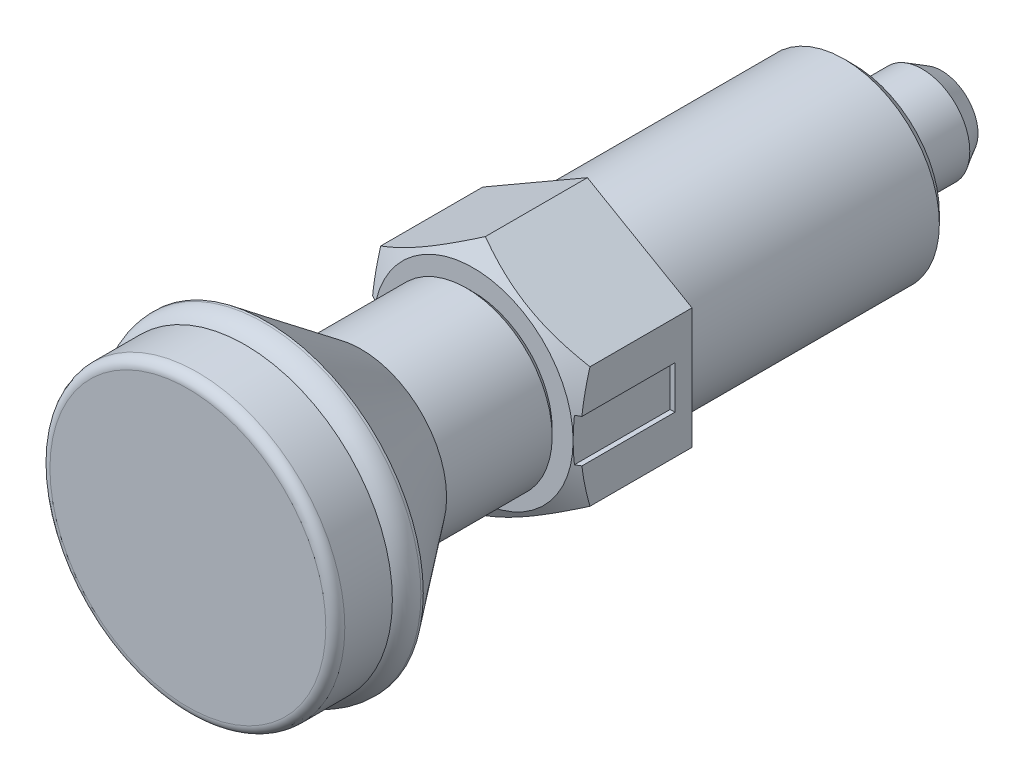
ISO-10303-21;
HEADER;
FILE_DESCRIPTION(('STEP AP214'),'2;1');
FILE_NAME('part.step','',(''),(''),'','','');
FILE_SCHEMA(('AUTOMOTIVE_DESIGN { 1 0 10303 214 1 1 1 1 }'));
ENDSEC;
DATA;
#1=APPLICATION_CONTEXT('core data for automotive mechanical design processes');
#2=APPLICATION_PROTOCOL_DEFINITION('international standard','automotive_design',2000,#1);
#3=PRODUCT_CONTEXT('',#1,'mechanical');
#4=PRODUCT('Part','Part','',(#3));
#5=PRODUCT_RELATED_PRODUCT_CATEGORY('part','',(#4));
#6=PRODUCT_DEFINITION_FORMATION('','',#4);
#7=PRODUCT_DEFINITION_CONTEXT('part definition',#1,'design');
#8=PRODUCT_DEFINITION('design','',#6,#7);
#9=PRODUCT_DEFINITION_SHAPE('','',#8);
#10=(LENGTH_UNIT() NAMED_UNIT(*) SI_UNIT(.MILLI.,.METRE.));
#11=(NAMED_UNIT(*) PLANE_ANGLE_UNIT() SI_UNIT($,.RADIAN.));
#12=(NAMED_UNIT(*) SI_UNIT($,.STERADIAN.) SOLID_ANGLE_UNIT());
#13=UNCERTAINTY_MEASURE_WITH_UNIT(LENGTH_MEASURE(1.E-05),#10,'distance_accuracy_value','');
#14=(GEOMETRIC_REPRESENTATION_CONTEXT(3) GLOBAL_UNCERTAINTY_ASSIGNED_CONTEXT((#13)) GLOBAL_UNIT_ASSIGNED_CONTEXT((#10,
#11,#12)) REPRESENTATION_CONTEXT('',''));
#15=CARTESIAN_POINT('',(0.,0.,0.));
#16=DIRECTION('',(0.,0.,1.));
#17=DIRECTION('',(1.,0.,0.));
#18=AXIS2_PLACEMENT_3D('',#15,#16,#17);
#19=CARTESIAN_POINT('',(-2.10129490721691E-12,1.21944953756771E-12,12.));
#20=DIRECTION('',(1.75107908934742E-13,-1.01620794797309E-13,-1.));
#21=DIRECTION('',(-1.,0.,-1.75107908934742E-13));
#22=AXIS2_PLACEMENT_3D('',#19,#20,#21);
#23=CONICAL_SURFACE('',#22,10.499999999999,1.0471975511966);
#24=CARTESIAN_POINT('',(10.9999999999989,-16.8033913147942,6.46686326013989));
#25=CARTESIAN_POINT('',(10.9999999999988,-16.5620742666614,6.58342928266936));
#26=CARTESIAN_POINT('',(10.9999999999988,-16.3204643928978,6.69938879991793));
#27=CARTESIAN_POINT('',(10.9999999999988,-15.8365971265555,6.92995551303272));
#28=CARTESIAN_POINT('',(10.9999999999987,-15.5943397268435,7.04456269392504));
#29=CARTESIAN_POINT('',(10.9999999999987,-14.8664318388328,7.38618027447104));
#30=CARTESIAN_POINT('',(10.9999999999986,-14.379724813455,7.6109483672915));
#31=CARTESIAN_POINT('',(10.9999999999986,-13.4001281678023,8.05434060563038));
#32=CARTESIAN_POINT('',(10.9999999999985,-12.9072190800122,8.27292185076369));
#33=CARTESIAN_POINT('',(10.9999999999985,-11.917335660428,8.70064166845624));
#34=CARTESIAN_POINT('',(10.9999999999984,-11.4203615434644,8.90978073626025));
#35=CARTESIAN_POINT('',(10.9999999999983,-10.4155733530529,9.31850427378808));
#36=CARTESIAN_POINT('',(10.9999999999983,-9.90770066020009,9.51794543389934));
#37=CARTESIAN_POINT('',(10.9999999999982,-8.88595211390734,9.90110782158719));
#38=CARTESIAN_POINT('',(10.9999999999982,-8.37207559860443,10.0848272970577));
#39=CARTESIAN_POINT('',(10.9999999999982,-7.33856431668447,10.4315794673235));
#40=CARTESIAN_POINT('',(10.9999999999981,-6.81894458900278,10.5946564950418));
#41=CARTESIAN_POINT('',(10.9999999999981,-5.77233865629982,10.8948046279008));
#42=CARTESIAN_POINT('',(10.9999999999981,-5.24535484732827,11.0318839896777));
#43=CARTESIAN_POINT('',(10.999999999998,-4.18355667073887,11.2733499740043));
#44=CARTESIAN_POINT('',(10.999999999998,-3.64873977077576,11.3777257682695));
#45=CARTESIAN_POINT('',(10.999999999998,-2.84184292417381,11.5045125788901));
#46=CARTESIAN_POINT('',(10.999999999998,-2.57206571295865,11.5418147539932));
#47=CARTESIAN_POINT('',(10.999999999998,-2.0312594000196,11.6057590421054));
#48=CARTESIAN_POINT('',(10.9999999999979,-1.76023041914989,11.632402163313));
#49=CARTESIAN_POINT('',(10.9999999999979,-1.21898438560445,11.6743130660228));
#50=CARTESIAN_POINT('',(10.9999999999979,-0.948772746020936,11.6896504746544));
#51=CARTESIAN_POINT('',(10.9999999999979,-0.407943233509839,11.7088695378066));
#52=CARTESIAN_POINT('',(10.9999999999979,-0.13732536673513,11.7127513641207));
#53=CARTESIAN_POINT('',(10.9999999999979,0.403755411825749,11.7089669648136));
#54=CARTESIAN_POINT('',(10.9999999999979,0.674218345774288,11.7013039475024));
#55=CARTESIAN_POINT('',(10.9999999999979,1.21458707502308,11.6746193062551));
#56=CARTESIAN_POINT('',(10.999999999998,1.48449283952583,11.6555970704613));
#57=CARTESIAN_POINT('',(10.999999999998,2.13975155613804,11.5960223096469));
#58=CARTESIAN_POINT('',(10.999999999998,2.52459164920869,11.5497180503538));
#59=CARTESIAN_POINT('',(10.999999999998,3.29123006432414,11.436603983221));
#60=CARTESIAN_POINT('',(10.999999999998,3.67302792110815,11.3697910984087));
#61=CARTESIAN_POINT('',(10.999999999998,4.81453751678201,11.1419434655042));
#62=CARTESIAN_POINT('',(10.9999999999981,5.56887050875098,10.9536528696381));
#63=CARTESIAN_POINT('',(10.9999999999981,6.69714810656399,10.6293211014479));
#64=CARTESIAN_POINT('',(10.9999999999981,7.076996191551,10.5126543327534));
#65=CARTESIAN_POINT('',(10.9999999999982,7.83302288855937,10.2677701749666));
#66=CARTESIAN_POINT('',(10.9999999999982,8.20920116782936,10.1395517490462));
#67=CARTESIAN_POINT('',(10.9999999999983,8.95600996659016,9.87430554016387));
#68=CARTESIAN_POINT('',(10.9999999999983,9.32665982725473,9.73733166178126));
#69=CARTESIAN_POINT('',(10.9999999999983,10.0648107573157,9.45550377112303));
#70=CARTESIAN_POINT('',(10.9999999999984,10.432312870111,9.31065249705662));
#71=CARTESIAN_POINT('',(10.9999999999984,10.798490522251,9.16260110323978));
#72=B_SPLINE_CURVE_WITH_KNOTS('',3,(#24,#25,#26,#27,#28,#29,#30,#31,#32,#33,#34,#35,#36,#37,#38,
#39,#40,#41,#42,#43,#44,#45,#46,#47,#48,#49,#50,#51,#52,#53,#54,#55,#56,#57,#58,#59,#60,#61,#62,
#63,#64,#65,#66,#67,#68,#69,#70,#71),.UNSPECIFIED.,.F.,.F.,(4,2,2,2,2,2,2,2,2,2,2,2,2,2,2,2,2,2,
2,2,2,2,2,4),(0.,0.803984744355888,1.6079783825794,3.21622949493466,4.8337540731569,
6.45119371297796,8.08788018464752,9.72474882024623,11.3580401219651,12.990811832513,
14.6241235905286,15.4409776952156,16.2577545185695,17.0694581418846,17.8811495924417,
18.6926155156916,19.5041251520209,20.6663113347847,21.8286719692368,24.1578810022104,
25.3498722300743,26.5419705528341,27.7273290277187,28.912278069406),.UNSPECIFIED.);
#73=CARTESIAN_POINT('',(10.9999999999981,-6.35085296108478,10.7288444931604));
#74=VERTEX_POINT('',#73);
#75=CARTESIAN_POINT('',(10.999999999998,-2.24999999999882,11.5798300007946));
#76=VERTEX_POINT('',#75);
#77=EDGE_CURVE('E242',#74,#76,#72,.T.);
#78=ORIENTED_EDGE('',*,*,#77,.T.);
#79=CARTESIAN_POINT('',(13.2143219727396,-2.24999999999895,10.3230821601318));
#80=CARTESIAN_POINT('',(12.8180176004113,-2.24999999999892,10.5486306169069));
#81=CARTESIAN_POINT('',(12.4216001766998,-2.2499999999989,10.773980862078));
#82=CARTESIAN_POINT('',(11.6284406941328,-2.24999999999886,11.2241053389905));
#83=CARTESIAN_POINT('',(11.2316986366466,-2.24999999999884,11.4488795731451));
#84=CARTESIAN_POINT('',(10.4377870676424,-2.24999999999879,11.8976748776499));
#85=CARTESIAN_POINT('',(10.0406175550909,-2.24999999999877,12.1216959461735));
#86=CARTESIAN_POINT('',(9.24565883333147,-2.24999999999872,12.5686394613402));
#87=CARTESIAN_POINT('',(8.84786962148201,-2.2499999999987,12.7915619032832));
#88=CARTESIAN_POINT('',(8.44967565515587,-2.24999999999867,13.0137616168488));
#89=B_SPLINE_CURVE_WITH_KNOTS('',3,(#79,#80,#81,#82,#83,#84,#85,#86,#87,#88),.UNSPECIFIED.,.F.,
.F.,(4,2,2,2,4),(0.,1.3679780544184,2.73595036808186,4.10392599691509,5.4719074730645),.UNSPECIFIED.);
#90=CARTESIAN_POINT('',(10.4999999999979,-2.2499999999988,11.862379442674));
#91=VERTEX_POINT('',#90);
#92=EDGE_CURVE('E129',#76,#91,#89,.T.);
#93=ORIENTED_EDGE('',*,*,#92,.T.);
#94=CARTESIAN_POINT('',(10.4999999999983,-10.5016397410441,9.48829427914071));
#95=CARTESIAN_POINT('',(10.4999999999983,-10.1480857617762,9.63259255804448));
#96=CARTESIAN_POINT('',(10.4999999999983,-9.79326680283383,9.77386167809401));
#97=CARTESIAN_POINT('',(10.4999999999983,-9.0806108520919,10.0489270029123));
#98=CARTESIAN_POINT('',(10.4999999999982,-8.72277287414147,10.1827206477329));
#99=CARTESIAN_POINT('',(10.4999999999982,-8.00170627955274,10.4420844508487));
#100=CARTESIAN_POINT('',(10.4999999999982,-7.63845830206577,10.5676013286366));
#101=CARTESIAN_POINT('',(10.4999999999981,-6.90840911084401,10.8076147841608));
#102=CARTESIAN_POINT('',(10.4999999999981,-6.5416082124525,10.9221123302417));
#103=CARTESIAN_POINT('',(10.499999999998,-5.44746660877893,11.2422605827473));
#104=CARTESIAN_POINT('',(10.499999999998,-4.71427801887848,11.4290647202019));
#105=CARTESIAN_POINT('',(10.499999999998,-3.6044809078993,11.6558505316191));
#106=CARTESIAN_POINT('',(10.499999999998,-3.23326579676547,11.7225012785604));
#107=CARTESIAN_POINT('',(10.4999999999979,-2.48776334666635,11.8356274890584));
#108=CARTESIAN_POINT('',(10.4999999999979,-2.11347657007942,11.8821065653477));
#109=CARTESIAN_POINT('',(10.4999999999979,-1.49818056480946,11.9401306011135));
#110=CARTESIAN_POINT('',(10.4999999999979,-1.25777463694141,11.9582289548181));
#111=CARTESIAN_POINT('',(10.4999999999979,-0.776442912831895,11.9850205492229));
#112=CARTESIAN_POINT('',(10.4999999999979,-0.535517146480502,11.9937143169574));
#113=CARTESIAN_POINT('',(10.4999999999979,-0.0534423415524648,12.0015183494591));
#114=CARTESIAN_POINT('',(10.4999999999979,0.187706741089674,12.0006258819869));
#115=CARTESIAN_POINT('',(10.4999999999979,0.669781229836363,11.9892707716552));
#116=CARTESIAN_POINT('',(10.4999999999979,0.910706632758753,11.9788079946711));
#117=CARTESIAN_POINT('',(10.4999999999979,1.39263552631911,11.9484799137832));
#118=CARTESIAN_POINT('',(10.4999999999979,1.63363737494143,11.9285885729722));
#119=CARTESIAN_POINT('',(10.4999999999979,2.1147291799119,11.8797848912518));
#120=CARTESIAN_POINT('',(10.4999999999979,2.3548190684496,11.8508718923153));
#121=CARTESIAN_POINT('',(10.499999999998,3.07324960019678,11.7513673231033));
#122=CARTESIAN_POINT('',(10.499999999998,3.549863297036,11.6680026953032));
#123=CARTESIAN_POINT('',(10.499999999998,4.39303769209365,11.4938370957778));
#124=CARTESIAN_POINT('',(10.499999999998,4.76080498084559,11.4086790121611));
#125=CARTESIAN_POINT('',(10.4999999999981,5.49253915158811,11.2233199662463));
#126=CARTESIAN_POINT('',(10.4999999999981,5.8565058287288,11.1231181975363));
#127=CARTESIAN_POINT('',(10.4999999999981,6.58114600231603,10.9099259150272));
#128=CARTESIAN_POINT('',(10.4999999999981,6.94181469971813,10.7969192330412));
#129=CARTESIAN_POINT('',(10.4999999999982,7.65963059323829,10.560331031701));
#130=CARTESIAN_POINT('',(10.4999999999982,8.0167779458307,10.4367499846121));
#131=CARTESIAN_POINT('',(10.4999999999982,8.72687150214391,10.1811575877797));
#132=CARTESIAN_POINT('',(10.4999999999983,9.0798268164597,10.0491714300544));
#133=CARTESIAN_POINT('',(10.4999999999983,9.78293196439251,9.77790767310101));
#134=CARTESIAN_POINT('',(10.4999999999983,10.1330816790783,9.63862976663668));
#135=CARTESIAN_POINT('',(10.4999999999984,10.8296795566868,9.3544936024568));
#136=CARTESIAN_POINT('',(10.4999999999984,11.176136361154,9.20965645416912));
#137=CARTESIAN_POINT('',(10.4999999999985,11.8668201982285,8.91490432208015));
#138=CARTESIAN_POINT('',(10.4999999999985,12.2110475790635,8.76499015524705));
#139=CARTESIAN_POINT('',(10.4999999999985,12.5543357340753,8.61299186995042));
#140=B_SPLINE_CURVE_WITH_KNOTS('',3,(#94,#95,#96,#97,#98,#99,#100,#101,#102,#103,#104,#105,#106,
#107,#108,#109,#110,#111,#112,#113,#114,#115,#116,#117,#118,#119,#120,#121,#122,#123,#124,#125,
#126,#127,#128,#129,#130,#131,#132,#133,#134,#135,#136,#137,#138,#139),.UNSPECIFIED.,.F.,.F.,(4,
2,2,2,2,2,2,2,2,2,2,2,2,2,2,2,2,2,2,2,2,2,4),(0.,1.14562331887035,2.29163657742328,
3.44442353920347,4.59710910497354,6.86378904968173,7.99480865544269,9.12562561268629,
9.84872135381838,10.5717765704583,11.2950378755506,12.0183093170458,12.7435898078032,
13.4689232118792,14.919253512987,16.0514312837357,17.1836697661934,18.3173541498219,
19.4509879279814,20.5813707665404,21.7118012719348,22.838297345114,23.9646130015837),.UNSPECIFIED.);
#141=CARTESIAN_POINT('',(10.4999999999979,1.21944953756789E-12,12.0000000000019));
#142=VERTEX_POINT('',#141);
#143=EDGE_CURVE('E430',#91,#142,#140,.T.);
#144=ORIENTED_EDGE('',*,*,#143,.T.);
#145=CARTESIAN_POINT('',(-2.10129490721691E-12,1.21944953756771E-12,12.));
#146=DIRECTION('',(-1.75107908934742E-13,1.01620794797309E-13,1.));
#147=DIRECTION('',(1.,0.,1.75107908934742E-13));
#148=AXIS2_PLACEMENT_3D('',#145,#146,#147);
#149=CIRCLE('',#148,10.499999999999);
#150=CARTESIAN_POINT('',(-10.5000000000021,1.21944953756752E-12,11.9999999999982));
#151=VERTEX_POINT('',#150);
#152=EDGE_CURVE('E398',#151,#142,#149,.T.);
#153=ORIENTED_EDGE('',*,*,#152,.F.);
#154=CARTESIAN_POINT('',(-10.5000000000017,-10.5016397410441,9.48829427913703));
#155=CARTESIAN_POINT('',(-10.5000000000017,-10.1480857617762,9.6325925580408));
#156=CARTESIAN_POINT('',(-10.5000000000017,-9.79326680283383,9.77386167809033));
#157=CARTESIAN_POINT('',(-10.5000000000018,-9.0806108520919,10.0489270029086));
#158=CARTESIAN_POINT('',(-10.5000000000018,-8.72277287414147,10.1827206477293));
#159=CARTESIAN_POINT('',(-10.5000000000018,-8.00170627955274,10.442084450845));
#160=CARTESIAN_POINT('',(-10.5000000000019,-7.63845830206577,10.5676013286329));
#161=CARTESIAN_POINT('',(-10.5000000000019,-6.90840911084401,10.8076147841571));
#162=CARTESIAN_POINT('',(-10.5000000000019,-6.54160821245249,10.922112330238));
#163=CARTESIAN_POINT('',(-10.500000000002,-5.44746660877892,11.2422605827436));
#164=CARTESIAN_POINT('',(-10.500000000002,-4.71427801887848,11.4290647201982));
#165=CARTESIAN_POINT('',(-10.500000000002,-3.6044809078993,11.6558505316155));
#166=CARTESIAN_POINT('',(-10.5000000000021,-3.23326579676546,11.7225012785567));
#167=CARTESIAN_POINT('',(-10.5000000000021,-2.48776334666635,11.8356274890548));
#168=CARTESIAN_POINT('',(-10.5000000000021,-2.11347657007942,11.882106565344));
#169=CARTESIAN_POINT('',(-10.5000000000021,-1.49818056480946,11.9401306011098));
#170=CARTESIAN_POINT('',(-10.5000000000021,-1.25777463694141,11.9582289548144));
#171=CARTESIAN_POINT('',(-10.5000000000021,-0.776442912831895,11.9850205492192));
#172=CARTESIAN_POINT('',(-10.5000000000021,-0.535517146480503,11.9937143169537));
#173=CARTESIAN_POINT('',(-10.5000000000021,-0.0534423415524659,12.0015183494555));
#174=CARTESIAN_POINT('',(-10.5000000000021,0.187706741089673,12.0006258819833));
#175=CARTESIAN_POINT('',(-10.5000000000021,0.669781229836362,11.9892707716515));
#176=CARTESIAN_POINT('',(-10.5000000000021,0.910706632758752,11.9788079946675));
#177=CARTESIAN_POINT('',(-10.5000000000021,1.39263552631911,11.9484799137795));
#178=CARTESIAN_POINT('',(-10.5000000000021,1.63363737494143,11.9285885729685));
#179=CARTESIAN_POINT('',(-10.5000000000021,2.1147291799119,11.8797848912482));
#180=CARTESIAN_POINT('',(-10.5000000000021,2.3548190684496,11.8508718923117));
#181=CARTESIAN_POINT('',(-10.5000000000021,3.07324960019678,11.7513673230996));
#182=CARTESIAN_POINT('',(-10.500000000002,3.549863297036,11.6680026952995));
#183=CARTESIAN_POINT('',(-10.500000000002,4.39303769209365,11.4938370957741));
#184=CARTESIAN_POINT('',(-10.500000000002,4.7608049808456,11.4086790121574));
#185=CARTESIAN_POINT('',(-10.500000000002,5.49253915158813,11.2233199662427));
#186=CARTESIAN_POINT('',(-10.500000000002,5.85650582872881,11.1231181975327));
#187=CARTESIAN_POINT('',(-10.5000000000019,6.58114600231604,10.9099259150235));
#188=CARTESIAN_POINT('',(-10.5000000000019,6.94181469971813,10.7969192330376));
#189=CARTESIAN_POINT('',(-10.5000000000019,7.65963059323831,10.5603310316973));
#190=CARTESIAN_POINT('',(-10.5000000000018,8.01677794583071,10.4367499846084));
#191=CARTESIAN_POINT('',(-10.5000000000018,8.72687150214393,10.1811575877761));
#192=CARTESIAN_POINT('',(-10.5000000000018,9.07982681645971,10.0491714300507));
#193=CARTESIAN_POINT('',(-10.5000000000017,9.78293196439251,9.77790767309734));
#194=CARTESIAN_POINT('',(-10.5000000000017,10.1330816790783,9.63862976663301));
#195=CARTESIAN_POINT('',(-10.5000000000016,10.8296795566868,9.35449360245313));
#196=CARTESIAN_POINT('',(-10.5000000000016,11.176136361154,9.20965645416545));
#197=CARTESIAN_POINT('',(-10.5000000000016,11.8668201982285,8.91490432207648));
#198=CARTESIAN_POINT('',(-10.5000000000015,12.2110475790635,8.76499015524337));
#199=CARTESIAN_POINT('',(-10.5000000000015,12.5543357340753,8.61299186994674));
#200=B_SPLINE_CURVE_WITH_KNOTS('',3,(#154,#155,#156,#157,#158,#159,#160,#161,#162,#163,#164,
#165,#166,#167,#168,#169,#170,#171,#172,#173,#174,#175,#176,#177,#178,#179,#180,#181,#182,#183,
#184,#185,#186,#187,#188,#189,#190,#191,#192,#193,#194,#195,#196,#197,#198,#199),.UNSPECIFIED.,
.F.,.F.,(4,2,2,2,2,2,2,2,2,2,2,2,2,2,2,2,2,2,2,2,2,2,4),(0.,1.14562331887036,2.29163657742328,
3.44442353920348,4.59710910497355,6.86378904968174,7.9948086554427,9.12562561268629,
9.84872135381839,10.5717765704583,11.2950378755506,12.0183093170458,12.7435898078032,
13.4689232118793,14.919253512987,16.0514312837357,17.1836697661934,18.3173541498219,
19.4509879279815,20.5813707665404,21.7118012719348,22.838297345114,23.9646130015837),.UNSPECIFIED.);
#201=CARTESIAN_POINT('',(-10.5000000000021,-2.2499999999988,11.8623794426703));
#202=VERTEX_POINT('',#201);
#203=EDGE_CURVE('E187',#151,#202,#200,.F.);
#204=ORIENTED_EDGE('',*,*,#203,.T.);
#205=CARTESIAN_POINT('',(-13.2143219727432,-2.24999999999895,10.3230821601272));
#206=CARTESIAN_POINT('',(-12.818017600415,-2.24999999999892,10.5486306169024));
#207=CARTESIAN_POINT('',(-12.4216001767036,-2.2499999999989,10.7739808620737));
#208=CARTESIAN_POINT('',(-11.6284406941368,-2.24999999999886,11.2241053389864));
#209=CARTESIAN_POINT('',(-11.2316986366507,-2.24999999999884,11.4488795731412));
#210=CARTESIAN_POINT('',(-10.4377870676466,-2.24999999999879,11.8976748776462));
#211=CARTESIAN_POINT('',(-10.0406175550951,-2.24999999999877,12.12169594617));
#212=CARTESIAN_POINT('',(-9.24565883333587,-2.24999999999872,12.5686394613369));
#213=CARTESIAN_POINT('',(-8.84786962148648,-2.2499999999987,12.7915619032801));
#214=CARTESIAN_POINT('',(-8.44967565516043,-2.24999999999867,13.0137616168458));
#215=B_SPLINE_CURVE_WITH_KNOTS('',3,(#205,#206,#207,#208,#209,#210,#211,#212,#213,#214),
.UNSPECIFIED.,.F.,.F.,(4,2,2,2,4),(0.,1.3679780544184,2.73595036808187,4.1039259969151,
5.47190747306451),.UNSPECIFIED.);
#216=CARTESIAN_POINT('',(-11.000000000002,-2.24999999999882,11.5798300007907));
#217=VERTEX_POINT('',#216);
#218=EDGE_CURVE('E424',#217,#202,#215,.T.);
#219=ORIENTED_EDGE('',*,*,#218,.F.);
#220=CARTESIAN_POINT('',(-11.0000000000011,-16.8033913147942,6.46686326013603));
#221=CARTESIAN_POINT('',(-11.0000000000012,-16.5620742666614,6.5834292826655));
#222=CARTESIAN_POINT('',(-11.0000000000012,-16.3204643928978,6.69938879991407));
#223=CARTESIAN_POINT('',(-11.0000000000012,-15.8365971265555,6.92995551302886));
#224=CARTESIAN_POINT('',(-11.0000000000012,-15.5943397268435,7.04456269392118));
#225=CARTESIAN_POINT('',(-11.0000000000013,-14.8664318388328,7.38618027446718));
#226=CARTESIAN_POINT('',(-11.0000000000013,-14.379724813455,7.61094836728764));
#227=CARTESIAN_POINT('',(-11.0000000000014,-13.4001281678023,8.05434060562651));
#228=CARTESIAN_POINT('',(-11.0000000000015,-12.9072190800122,8.27292185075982));
#229=CARTESIAN_POINT('',(-11.0000000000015,-11.9173356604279,8.70064166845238));
#230=CARTESIAN_POINT('',(-11.0000000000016,-11.4203615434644,8.90978073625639));
#231=CARTESIAN_POINT('',(-11.0000000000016,-10.4155733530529,9.31850427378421));
#232=CARTESIAN_POINT('',(-11.0000000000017,-9.90770066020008,9.51794543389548));
#233=CARTESIAN_POINT('',(-11.0000000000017,-8.88595211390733,9.90110782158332));
#234=CARTESIAN_POINT('',(-11.0000000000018,-8.37207559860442,10.0848272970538));
#235=CARTESIAN_POINT('',(-11.0000000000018,-7.33856431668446,10.4315794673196));
#236=CARTESIAN_POINT('',(-11.0000000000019,-6.81894458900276,10.5946564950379));
#237=CARTESIAN_POINT('',(-11.0000000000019,-5.77233865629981,10.894804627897));
#238=CARTESIAN_POINT('',(-11.0000000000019,-5.24535484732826,11.0318839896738));
#239=CARTESIAN_POINT('',(-11.000000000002,-4.18355667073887,11.2733499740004));
#240=CARTESIAN_POINT('',(-11.000000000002,-3.64873977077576,11.3777257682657));
#241=CARTESIAN_POINT('',(-11.000000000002,-2.84184292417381,11.5045125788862));
#242=CARTESIAN_POINT('',(-11.000000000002,-2.57206571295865,11.5418147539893));
#243=CARTESIAN_POINT('',(-11.000000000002,-2.0312594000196,11.6057590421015));
#244=CARTESIAN_POINT('',(-11.0000000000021,-1.76023041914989,11.6324021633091));
#245=CARTESIAN_POINT('',(-11.0000000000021,-1.21898438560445,11.6743130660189));
#246=CARTESIAN_POINT('',(-11.0000000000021,-0.948772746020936,11.6896504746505));
#247=CARTESIAN_POINT('',(-11.0000000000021,-0.407943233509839,11.7088695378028));
#248=CARTESIAN_POINT('',(-11.0000000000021,-0.13732536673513,11.7127513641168));
#249=CARTESIAN_POINT('',(-11.0000000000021,0.403755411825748,11.7089669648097));
#250=CARTESIAN_POINT('',(-11.0000000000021,0.674218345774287,11.7013039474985));
#251=CARTESIAN_POINT('',(-11.0000000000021,1.21458707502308,11.6746193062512));
#252=CARTESIAN_POINT('',(-11.000000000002,1.48449283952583,11.6555970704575));
#253=CARTESIAN_POINT('',(-11.000000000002,2.13975155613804,11.596022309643));
#254=CARTESIAN_POINT('',(-11.000000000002,2.52459164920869,11.5497180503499));
#255=CARTESIAN_POINT('',(-11.000000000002,3.29123006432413,11.4366039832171));
#256=CARTESIAN_POINT('',(-11.000000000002,3.67302792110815,11.3697910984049));
#257=CARTESIAN_POINT('',(-11.000000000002,4.81453751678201,11.1419434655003));
#258=CARTESIAN_POINT('',(-11.0000000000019,5.56887050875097,10.9536528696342));
#259=CARTESIAN_POINT('',(-11.0000000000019,6.69714810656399,10.6293211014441));
#260=CARTESIAN_POINT('',(-11.0000000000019,7.076996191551,10.5126543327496));
#261=CARTESIAN_POINT('',(-11.0000000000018,7.83302288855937,10.2677701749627));
#262=CARTESIAN_POINT('',(-11.0000000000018,8.20920116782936,10.1395517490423));
#263=CARTESIAN_POINT('',(-11.0000000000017,8.95600996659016,9.87430554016));
#264=CARTESIAN_POINT('',(-11.0000000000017,9.32665982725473,9.7373316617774));
#265=CARTESIAN_POINT('',(-11.0000000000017,10.0648107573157,9.45550377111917));
#266=CARTESIAN_POINT('',(-11.0000000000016,10.432312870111,9.31065249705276));
#267=CARTESIAN_POINT('',(-11.0000000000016,10.798490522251,9.16260110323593));
#268=B_SPLINE_CURVE_WITH_KNOTS('',3,(#220,#221,#222,#223,#224,#225,#226,#227,#228,#229,#230,
#231,#232,#233,#234,#235,#236,#237,#238,#239,#240,#241,#242,#243,#244,#245,#246,#247,#248,#249,
#250,#251,#252,#253,#254,#255,#256,#257,#258,#259,#260,#261,#262,#263,#264,#265,#266,#267),
.UNSPECIFIED.,.F.,.F.,(4,2,2,2,2,2,2,2,2,2,2,2,2,2,2,2,2,2,2,2,2,2,2,4),(0.,0.803984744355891,
1.6079783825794,3.21622949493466,4.8337540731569,6.45119371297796,8.08788018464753,
9.72474882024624,11.3580401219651,12.990811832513,14.6241235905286,15.4409776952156,
16.2577545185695,17.0694581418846,17.8811495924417,18.6926155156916,19.5041251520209,
20.6663113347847,21.8286719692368,24.1578810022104,25.3498722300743,26.5419705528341,
27.7273290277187,28.912278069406),.UNSPECIFIED.);
#269=CARTESIAN_POINT('',(-11.0000000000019,-6.35085296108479,10.7288444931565));
#270=VERTEX_POINT('',#269);
#271=EDGE_CURVE('E282',#217,#270,#268,.F.);
#272=ORIENTED_EDGE('',*,*,#271,.T.);
#273=CARTESIAN_POINT('',(-11.0002000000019,-6.35073749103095,10.7287778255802));
#274=CARTESIAN_POINT('',(-10.7583962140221,-6.49034297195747,10.8093657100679));
#275=CARTESIAN_POINT('',(-10.5156908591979,-6.63046897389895,10.886295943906));
#276=CARTESIAN_POINT('',(-10.0283338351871,-6.91184468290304,11.0318262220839));
#277=CARTESIAN_POINT('',(-9.78368155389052,-7.05309474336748,11.100423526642));
#278=CARTESIAN_POINT('',(-9.04578263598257,-7.47912088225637,11.2923885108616));
#279=CARTESIAN_POINT('',(-8.54962304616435,-7.76557875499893,11.4015771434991));
#280=CARTESIAN_POINT('',(-7.80714296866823,-8.19424982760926,11.5296107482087));
#281=CARTESIAN_POINT('',(-7.56304065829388,-8.3351823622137,11.5660826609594));
#282=CARTESIAN_POINT('',(-7.07370581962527,-8.61769996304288,11.6272435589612));
#283=CARTESIAN_POINT('',(-6.82847326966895,-8.75928504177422,11.6519323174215));
#284=CARTESIAN_POINT('',(-6.33759931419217,-9.04269125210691,11.6888945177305));
#285=CARTESIAN_POINT('',(-6.09195874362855,-9.18451190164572,11.7011827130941));
#286=CARTESIAN_POINT('',(-5.6004499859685,-9.4682846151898,11.713081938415));
#287=CARTESIAN_POINT('',(-5.3545818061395,-9.61023667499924,11.7126933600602));
#288=CARTESIAN_POINT('',(-4.89492981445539,-9.87561687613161,11.7001236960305));
#289=CARTESIAN_POINT('',(-4.68111322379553,-9.99906394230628,11.6894758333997));
#290=CARTESIAN_POINT('',(-4.2539718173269,-10.245674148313,11.6587932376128));
#291=CARTESIAN_POINT('',(-4.04064703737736,-10.3688372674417,11.6387578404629));
#292=CARTESIAN_POINT('',(-3.61460518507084,-10.6148126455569,11.5896494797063));
#293=CARTESIAN_POINT('',(-3.40188876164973,-10.7376245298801,11.560569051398));
#294=CARTESIAN_POINT('',(-2.97745318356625,-10.9826725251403,11.4938808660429));
#295=CARTESIAN_POINT('',(-2.76573409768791,-11.1049085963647,11.456272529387));
#296=CARTESIAN_POINT('',(-2.12304886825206,-11.4759630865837,11.3297049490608));
#297=CARTESIAN_POINT('',(-1.69394387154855,-11.7237069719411,11.2281254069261));
#298=CARTESIAN_POINT('',(-0.842132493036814,-12.2155005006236,10.9975811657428));
#299=CARTESIAN_POINT('',(-0.41941520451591,-12.4595564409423,10.8686706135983));
#300=CARTESIAN_POINT('',(0.000199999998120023,-12.7018213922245,10.7287778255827));
#301=B_SPLINE_CURVE_WITH_KNOTS('',3,(#273,#274,#275,#276,#277,#278,#279,#280,#281,#282,#283,
#284,#285,#286,#287,#288,#289,#290,#291,#292,#293,#294,#295,#296,#297,#298,#299,#300),
.UNSPECIFIED.,.F.,.F.,(4,2,2,2,2,2,2,2,2,2,2,2,2,4),(0.,0.8717551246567,1.74379610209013,
3.49159027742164,4.34403665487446,5.19649943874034,6.04794680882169,6.89936787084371,
7.64056020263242,8.38180496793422,9.12366309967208,9.865571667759,11.3820155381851,
12.8954827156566),.UNSPECIFIED.);
#302=CARTESIAN_POINT('',(-1.87955105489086E-12,-12.7017059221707,10.7288444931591));
#303=VERTEX_POINT('',#302);
#304=EDGE_CURVE('E275',#270,#303,#301,.T.);
#305=ORIENTED_EDGE('',*,*,#304,.T.);
#306=CARTESIAN_POINT('',(-0.00020000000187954,-12.7018213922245,10.7287778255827));
#307=CARTESIAN_POINT('',(0.241603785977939,-12.562215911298,10.8093657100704));
#308=CARTESIAN_POINT('',(0.484309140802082,-12.4220899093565,10.8862959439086));
#309=CARTESIAN_POINT('',(0.971666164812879,-12.1407142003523,11.0318262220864));
#310=CARTESIAN_POINT('',(1.21631844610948,-11.9994641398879,11.1004235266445));
#311=CARTESIAN_POINT('',(1.95421736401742,-11.573438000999,11.2923885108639));
#312=CARTESIAN_POINT('',(2.45037695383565,-11.2869801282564,11.4015771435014));
#313=CARTESIAN_POINT('',(3.19285703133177,-10.858309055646,11.5296107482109));
#314=CARTESIAN_POINT('',(3.43695934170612,-10.7173765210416,11.5660826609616));
#315=CARTESIAN_POINT('',(3.92629418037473,-10.4348589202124,11.6272435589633));
#316=CARTESIAN_POINT('',(4.17152673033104,-10.293273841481,11.6519323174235));
#317=CARTESIAN_POINT('',(4.66240068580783,-10.0098676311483,11.6888945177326));
#318=CARTESIAN_POINT('',(4.90804125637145,-9.86804698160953,11.7011827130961));
#319=CARTESIAN_POINT('',(5.3995500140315,-9.58427426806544,11.7130819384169));
#320=CARTESIAN_POINT('',(5.6454181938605,-9.44232220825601,11.7126933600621));
#321=CARTESIAN_POINT('',(6.10507018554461,-9.17694200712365,11.7001236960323));
#322=CARTESIAN_POINT('',(6.31888677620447,-9.05349494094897,11.6894758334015));
#323=CARTESIAN_POINT('',(6.7460281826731,-8.80688473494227,11.6587932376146));
#324=CARTESIAN_POINT('',(6.95935296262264,-8.68372161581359,11.6387578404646));
#325=CARTESIAN_POINT('',(7.38539481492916,-8.43774623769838,11.589649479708));
#326=CARTESIAN_POINT('',(7.59811123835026,-8.31493435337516,11.5605690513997));
#327=CARTESIAN_POINT('',(8.02254681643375,-8.06988635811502,11.4938808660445));
#328=CARTESIAN_POINT('',(8.23426590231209,-7.94765028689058,11.4562725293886));
#329=CARTESIAN_POINT('',(8.87695113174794,-7.57659579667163,11.3297049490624));
#330=CARTESIAN_POINT('',(9.30605612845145,-7.32885191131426,11.2281254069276));
#331=CARTESIAN_POINT('',(10.1578675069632,-6.83705838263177,10.9975811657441));
#332=CARTESIAN_POINT('',(10.5805847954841,-6.59300244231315,10.8686706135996));
#333=CARTESIAN_POINT('',(11.0001999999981,-6.35073749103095,10.728777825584));
#334=B_SPLINE_CURVE_WITH_KNOTS('',3,(#306,#307,#308,#309,#310,#311,#312,#313,#314,#315,#316,
#317,#318,#319,#320,#321,#322,#323,#324,#325,#326,#327,#328,#329,#330,#331,#332,#333),
.UNSPECIFIED.,.F.,.F.,(4,2,2,2,2,2,2,2,2,2,2,2,2,4),(0.,0.8717551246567,1.74379610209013,
3.49159027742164,4.34403665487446,5.19649943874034,6.04794680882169,6.89936787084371,
7.64056020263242,8.38180496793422,9.12366309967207,9.865571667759,11.3820155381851,
12.8954827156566),.UNSPECIFIED.);
#335=EDGE_CURVE('E268',#303,#74,#334,.T.);
#336=ORIENTED_EDGE('',*,*,#335,.T.);
#337=EDGE_LOOP('',(#78,#93,#144,#153,#204,#219,#272,#305,#336));
#338=FACE_BOUND('',#337,.T.);
#339=ADVANCED_FACE('F14',(#338),#23,.T.);
#340=CARTESIAN_POINT('',(10.4999999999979,2.2500000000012,11.8623794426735));
#341=VERTEX_POINT('',#340);
#342=EDGE_CURVE('E433',#142,#341,#140,.T.);
#343=ORIENTED_EDGE('',*,*,#342,.T.);
#344=CARTESIAN_POINT('',(8.44967565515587,2.25000000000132,13.0137616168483));
#345=CARTESIAN_POINT('',(8.84786962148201,2.2500000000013,12.7915619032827));
#346=CARTESIAN_POINT('',(9.24565883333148,2.25000000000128,12.5686394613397));
#347=CARTESIAN_POINT('',(10.0406175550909,2.25000000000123,12.121695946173));
#348=CARTESIAN_POINT('',(10.4377870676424,2.25000000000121,11.8976748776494));
#349=CARTESIAN_POINT('',(11.2316986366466,2.25000000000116,11.4488795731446));
#350=CARTESIAN_POINT('',(11.6284406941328,2.25000000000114,11.22410533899));
#351=CARTESIAN_POINT('',(12.4216001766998,2.2500000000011,10.7739808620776));
#352=CARTESIAN_POINT('',(12.8180176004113,2.25000000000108,10.5486306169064));
#353=CARTESIAN_POINT('',(13.2143219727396,2.25000000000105,10.3230821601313));
#354=B_SPLINE_CURVE_WITH_KNOTS('',3,(#344,#345,#346,#347,#348,#349,#350,#351,#352,#353),
.UNSPECIFIED.,.F.,.F.,(4,2,2,2,4),(0.,1.36798147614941,2.73595710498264,4.10392941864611,
5.4719074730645),.UNSPECIFIED.);
#355=CARTESIAN_POINT('',(10.999999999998,2.25000000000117,11.5798300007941));
#356=VERTEX_POINT('',#355);
#357=EDGE_CURVE('E137',#341,#356,#354,.T.);
#358=ORIENTED_EDGE('',*,*,#357,.T.);
#359=CARTESIAN_POINT('',(10.9999999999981,6.35085296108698,10.7288444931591));
#360=VERTEX_POINT('',#359);
#361=EDGE_CURVE('E241',#356,#360,#72,.T.);
#362=ORIENTED_EDGE('',*,*,#361,.T.);
#363=CARTESIAN_POINT('',(11.0001999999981,6.35073749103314,10.7287778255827));
#364=CARTESIAN_POINT('',(10.7583962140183,6.49034297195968,10.8093657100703));
#365=CARTESIAN_POINT('',(10.5156908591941,6.63046897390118,10.8862959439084));
#366=CARTESIAN_POINT('',(10.0283338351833,6.91184468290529,11.031826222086));
#367=CARTESIAN_POINT('',(9.78368155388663,7.05309474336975,11.100423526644));
#368=CARTESIAN_POINT('',(9.04578263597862,7.47912088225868,11.2923885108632));
#369=CARTESIAN_POINT('',(8.54962304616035,7.76557875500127,11.4015771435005));
#370=CARTESIAN_POINT('',(7.80714296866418,8.19424982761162,11.5296107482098));
#371=CARTESIAN_POINT('',(7.56304065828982,8.33518236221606,11.5660826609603));
#372=CARTESIAN_POINT('',(7.07370581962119,8.61769996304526,11.6272435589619));
#373=CARTESIAN_POINT('',(6.82847326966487,8.7592850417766,11.6519323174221));
#374=CARTESIAN_POINT('',(6.33759931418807,9.04269125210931,11.6888945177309));
#375=CARTESIAN_POINT('',(6.09195874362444,9.18451190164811,11.7011827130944));
#376=CARTESIAN_POINT('',(5.6004499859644,9.4682846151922,11.713081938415));
#377=CARTESIAN_POINT('',(5.3545818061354,9.61023667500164,11.7126933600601));
#378=CARTESIAN_POINT('',(4.89492981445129,9.875616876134,11.7001236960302));
#379=CARTESIAN_POINT('',(4.68111322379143,9.99906394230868,11.6894758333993));
#380=CARTESIAN_POINT('',(4.25397181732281,10.2456741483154,11.6587932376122));
#381=CARTESIAN_POINT('',(4.04064703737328,10.368837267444,11.6387578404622));
#382=CARTESIAN_POINT('',(3.61460518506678,10.6148126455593,11.5896494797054));
#383=CARTESIAN_POINT('',(3.40188876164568,10.7376245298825,11.560569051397));
#384=CARTESIAN_POINT('',(2.97745318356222,10.9826725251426,11.4938808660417));
#385=CARTESIAN_POINT('',(2.76573409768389,11.1049085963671,11.4562725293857));
#386=CARTESIAN_POINT('',(2.12304886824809,11.475963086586,11.3297049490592));
#387=CARTESIAN_POINT('',(1.69394387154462,11.7237069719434,11.2281254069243));
#388=CARTESIAN_POINT('',(0.842132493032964,12.2155005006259,10.9975811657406));
#389=CARTESIAN_POINT('',(0.419415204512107,12.4595564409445,10.8686706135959));
#390=CARTESIAN_POINT('',(-0.000200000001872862,12.7018213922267,10.7287778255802));
#391=B_SPLINE_CURVE_WITH_KNOTS('',3,(#363,#364,#365,#366,#367,#368,#369,#370,#371,#372,#373,
#374,#375,#376,#377,#378,#379,#380,#381,#382,#383,#384,#385,#386,#387,#388,#389,#390),
.UNSPECIFIED.,.F.,.F.,(4,2,2,2,2,2,2,2,2,2,2,2,2,4),(0.,0.871755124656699,1.74379610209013,
3.49159027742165,4.34403665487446,5.19649943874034,6.04794680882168,6.89936787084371,
7.64056020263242,8.38180496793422,9.12366309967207,9.865571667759,11.3820155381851,
12.8954827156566),.UNSPECIFIED.);
#392=CARTESIAN_POINT('',(0.,12.7017059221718,10.7288444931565));
#393=VERTEX_POINT('',#392);
#394=EDGE_CURVE('E222',#360,#393,#391,.T.);
#395=ORIENTED_EDGE('',*,*,#394,.T.);
#396=CARTESIAN_POINT('',(0.000199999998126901,12.7018213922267,10.7287778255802));
#397=CARTESIAN_POINT('',(-0.241603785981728,12.5622159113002,10.8093657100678));
#398=CARTESIAN_POINT('',(-0.4843091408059,12.4220899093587,10.8862959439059));
#399=CARTESIAN_POINT('',(-0.97166616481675,12.1407142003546,11.0318262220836));
#400=CARTESIAN_POINT('',(-1.21631844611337,11.9994641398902,11.1004235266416));
#401=CARTESIAN_POINT('',(-1.95421736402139,11.5734380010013,11.2923885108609));
#402=CARTESIAN_POINT('',(-2.45037695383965,11.2869801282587,11.4015771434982));
#403=CARTESIAN_POINT('',(-3.19285703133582,10.8583090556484,11.5296107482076));
#404=CARTESIAN_POINT('',(-3.43695934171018,10.717376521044,11.5660826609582));
#405=CARTESIAN_POINT('',(-3.92629418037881,10.4348589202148,11.6272435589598));
#406=CARTESIAN_POINT('',(-4.17152673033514,10.2932738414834,11.65193231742));
#407=CARTESIAN_POINT('',(-4.66240068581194,10.0098676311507,11.6888945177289));
#408=CARTESIAN_POINT('',(-4.90804125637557,9.86804698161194,11.7011827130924));
#409=CARTESIAN_POINT('',(-5.39955001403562,9.58427426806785,11.7130819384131));
#410=CARTESIAN_POINT('',(-5.64541819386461,9.44232220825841,11.7126933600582));
#411=CARTESIAN_POINT('',(-6.10507018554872,9.17694200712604,11.7001236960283));
#412=CARTESIAN_POINT('',(-6.31888677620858,9.05349494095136,11.6894758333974));
#413=CARTESIAN_POINT('',(-6.7460281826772,8.80688473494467,11.6587932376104));
#414=CARTESIAN_POINT('',(-6.95935296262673,8.68372161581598,11.6387578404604));
#415=CARTESIAN_POINT('',(-7.38539481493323,8.43774623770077,11.5896494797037));
#416=CARTESIAN_POINT('',(-7.59811123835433,8.31493435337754,11.5605690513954));
#417=CARTESIAN_POINT('',(-8.02254681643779,8.06988635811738,11.4938808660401));
#418=CARTESIAN_POINT('',(-8.23426590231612,7.94765028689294,11.4562725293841));
#419=CARTESIAN_POINT('',(-8.87695113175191,7.57659579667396,11.3297049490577));
#420=CARTESIAN_POINT('',(-9.30605612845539,7.32885191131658,11.2281254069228));
#421=CARTESIAN_POINT('',(-10.157867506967,6.83705838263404,10.9975811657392));
#422=CARTESIAN_POINT('',(-10.5805847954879,6.59300244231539,10.8686706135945));
#423=CARTESIAN_POINT('',(-11.0002000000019,6.35073749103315,10.7287778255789));
#424=B_SPLINE_CURVE_WITH_KNOTS('',3,(#396,#397,#398,#399,#400,#401,#402,#403,#404,#405,#406,
#407,#408,#409,#410,#411,#412,#413,#414,#415,#416,#417,#418,#419,#420,#421,#422,#423),
.UNSPECIFIED.,.F.,.F.,(4,2,2,2,2,2,2,2,2,2,2,2,2,4),(0.,0.871755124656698,1.74379610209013,
3.49159027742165,4.34403665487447,5.19649943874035,6.0479468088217,6.89936787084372,
7.64056020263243,8.38180496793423,9.12366309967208,9.865571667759,11.3820155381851,
12.8954827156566),.UNSPECIFIED.);
#425=CARTESIAN_POINT('',(-11.0000000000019,6.35085296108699,10.7288444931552));
#426=VERTEX_POINT('',#425);
#427=EDGE_CURVE('E290',#393,#426,#424,.T.);
#428=ORIENTED_EDGE('',*,*,#427,.T.);
#429=CARTESIAN_POINT('',(-11.000000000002,2.25000000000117,11.5798300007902));
#430=VERTEX_POINT('',#429);
#431=EDGE_CURVE('E283',#426,#430,#268,.F.);
#432=ORIENTED_EDGE('',*,*,#431,.T.);
#433=CARTESIAN_POINT('',(-8.44967565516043,2.25000000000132,13.0137616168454));
#434=CARTESIAN_POINT('',(-8.84786962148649,2.2500000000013,12.7915619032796));
#435=CARTESIAN_POINT('',(-9.24565883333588,2.25000000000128,12.5686394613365));
#436=CARTESIAN_POINT('',(-10.0406175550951,2.25000000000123,12.1216959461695));
#437=CARTESIAN_POINT('',(-10.4377870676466,2.25000000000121,11.8976748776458));
#438=CARTESIAN_POINT('',(-11.2316986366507,2.25000000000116,11.4488795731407));
#439=CARTESIAN_POINT('',(-11.6284406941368,2.25000000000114,11.224105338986));
#440=CARTESIAN_POINT('',(-12.4216001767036,2.2500000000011,10.7739808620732));
#441=CARTESIAN_POINT('',(-12.818017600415,2.25000000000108,10.5486306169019));
#442=CARTESIAN_POINT('',(-13.2143219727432,2.25000000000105,10.3230821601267));
#443=B_SPLINE_CURVE_WITH_KNOTS('',3,(#433,#434,#435,#436,#437,#438,#439,#440,#441,#442),
.UNSPECIFIED.,.F.,.F.,(4,2,2,2,4),(0.,1.36798147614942,2.73595710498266,4.10392941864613,
5.47190747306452),.UNSPECIFIED.);
#444=CARTESIAN_POINT('',(-10.5000000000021,2.2500000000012,11.8623794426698));
#445=VERTEX_POINT('',#444);
#446=EDGE_CURVE('E196',#445,#430,#443,.T.);
#447=ORIENTED_EDGE('',*,*,#446,.F.);
#448=EDGE_CURVE('E195',#445,#151,#200,.F.);
#449=ORIENTED_EDGE('',*,*,#448,.T.);
#450=EDGE_CURVE('E397',#142,#151,#149,.T.);
#451=ORIENTED_EDGE('',*,*,#450,.F.);
#452=EDGE_LOOP('',(#343,#358,#362,#395,#428,#432,#447,#449,#451));
#453=FACE_BOUND('',#452,.T.);
#454=ADVANCED_FACE('F260',(#453),#23,.T.);
#455=CARTESIAN_POINT('',(10.999999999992,6.35085296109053,45.6055550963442));
#456=DIRECTION('',(1.,0.,1.75107908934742E-13));
#457=DIRECTION('',(0.,1.,-1.01620794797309E-13));
#458=AXIS2_PLACEMENT_3D('',#455,#456,#457);
#459=PLANE('',#458);
#460=DIRECTION('',(0.,-1.,1.01620794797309E-13));
#461=VECTOR('',#460,1.);
#462=CARTESIAN_POINT('',(10.9999999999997,2.25000000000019,1.80000000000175));
#463=LINE('',#462,#461);
#464=CARTESIAN_POINT('',(10.9999999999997,2.25000000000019,1.80000000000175));
#465=VERTEX_POINT('',#464);
#466=CARTESIAN_POINT('',(10.9999999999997,-2.24999999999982,1.80000000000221));
#467=VERTEX_POINT('',#466);
#468=EDGE_CURVE('E29',#465,#467,#463,.T.);
#469=ORIENTED_EDGE('',*,*,#468,.T.);
#470=DIRECTION('',(-1.75107908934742E-13,1.01620794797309E-13,1.));
#471=VECTOR('',#470,1.);
#472=CARTESIAN_POINT('',(10.9999999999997,-2.24999999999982,1.80000000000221));
#473=LINE('',#472,#471);
#474=EDGE_CURVE('E124',#467,#76,#473,.T.);
#475=ORIENTED_EDGE('',*,*,#474,.T.);
#476=ORIENTED_EDGE('',*,*,#77,.F.);
#477=DIRECTION('',(1.75107908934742E-13,-1.01620794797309E-13,-1.));
#478=VECTOR('',#477,1.);
#479=CARTESIAN_POINT('',(10.999999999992,-6.35085296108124,45.6055550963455));
#480=LINE('',#479,#478);
#481=CARTESIAN_POINT('',(11.,-6.35085296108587,2.57432963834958E-12));
#482=VERTEX_POINT('',#481);
#483=EDGE_CURVE('E210',#74,#482,#480,.T.);
#484=ORIENTED_EDGE('',*,*,#483,.T.);
#485=DIRECTION('',(0.,-1.,1.01620794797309E-13));
#486=VECTOR('',#485,1.);
#487=CARTESIAN_POINT('',(11.,6.35085296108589,1.28369537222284E-12));
#488=LINE('',#487,#486);
#489=CARTESIAN_POINT('',(10.9999999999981,6.35085296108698,1.28369537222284E-12));
#490=VERTEX_POINT('',#489);
#491=EDGE_CURVE('E215',#490,#482,#488,.T.);
#492=ORIENTED_EDGE('',*,*,#491,.F.);
#493=DIRECTION('',(1.75107908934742E-13,-1.01620794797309E-13,-1.));
#494=VECTOR('',#493,1.);
#495=CARTESIAN_POINT('',(10.999999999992,6.35085296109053,45.6055550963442));
#496=LINE('',#495,#494);
#497=EDGE_CURVE('E214',#360,#490,#496,.T.);
#498=ORIENTED_EDGE('',*,*,#497,.F.);
#499=ORIENTED_EDGE('',*,*,#361,.F.);
#500=DIRECTION('',(1.75107908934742E-13,-1.01620794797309E-13,-1.));
#501=VECTOR('',#500,1.);
#502=CARTESIAN_POINT('',(10.999999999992,2.25000000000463,45.6055550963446));
#503=LINE('',#502,#501);
#504=EDGE_CURVE('E9',#356,#465,#503,.T.);
#505=ORIENTED_EDGE('',*,*,#504,.T.);
#506=EDGE_LOOP('',(#469,#475,#476,#484,#492,#498,#499,#505));
#507=FACE_BOUND('',#506,.T.);
#508=ADVANCED_FACE('F140',(#507),#459,.T.);
#509=CARTESIAN_POINT('',(-5.95366890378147E-12,3.45510702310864E-12,34.0000000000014));
#510=DIRECTION('',(-1.75107908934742E-13,1.01620794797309E-13,1.));
#511=DIRECTION('',(1.,0.,1.75107908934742E-13));
#512=AXIS2_PLACEMENT_3D('',#509,#510,#511);
#513=TOROIDAL_SURFACE('',#512,14.0000000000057,2.49999999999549);
#514=CARTESIAN_POINT('',(-5.9536694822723E-12,3.45510735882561E-12,34.0000033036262));
#515=DIRECTION('',(-1.75107908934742E-13,1.01620794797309E-13,1.));
#516=DIRECTION('',(1.,0.,1.75107908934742E-13));
#517=AXIS2_PLACEMENT_3D('',#514,#515,#516);
#518=CIRCLE('',#517,16.499999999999);
#519=CARTESIAN_POINT('',(16.499999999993,3.4551073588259E-12,34.0000033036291));
#520=VERTEX_POINT('',#519);
#521=EDGE_CURVE('E413',#520,#520,#518,.T.);
#522=ORIENTED_EDGE('',*,*,#521,.T.);
#523=EDGE_LOOP('',(#522));
#524=FACE_BOUND('',#523,.T.);
#525=CARTESIAN_POINT('',(-6.30388472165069E-12,3.6583486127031E-12,36.));
#526=DIRECTION('',(-1.75107908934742E-13,1.01620794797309E-13,1.));
#527=DIRECTION('',(1.,0.,1.75107908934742E-13));
#528=AXIS2_PLACEMENT_3D('',#525,#526,#527);
#529=CIRCLE('',#528,15.5);
#530=CARTESIAN_POINT('',(15.4999999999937,3.65834861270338E-12,36.0000000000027));
#531=VERTEX_POINT('',#530);
#532=EDGE_CURVE('E370',#531,#531,#529,.T.);
#533=ORIENTED_EDGE('',*,*,#532,.F.);
#534=EDGE_LOOP('',(#533));
#535=FACE_BOUND('',#534,.T.);
#536=ADVANCED_FACE('F16',(#524,#535),#513,.T.);
#537=CARTESIAN_POINT('',(-7.35453217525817E-12,4.2680733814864E-12,41.9999999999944));
#538=DIRECTION('',(-1.75107908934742E-13,1.01620794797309E-13,1.));
#539=DIRECTION('',(1.,0.,1.75107908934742E-13));
#540=AXIS2_PLACEMENT_3D('',#537,#538,#539);
#541=CYLINDRICAL_SURFACE('',#540,16.499999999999);
#542=CARTESIAN_POINT('',(-5.91038856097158E-12,3.42999003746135E-12,33.7528361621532));
#543=DIRECTION('',(-1.75107908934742E-13,1.01620794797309E-13,1.));
#544=DIRECTION('',(1.,0.,1.75107908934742E-13));
#545=AXIS2_PLACEMENT_3D('',#542,#543,#544);
#546=CIRCLE('',#545,16.499999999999);
#547=CARTESIAN_POINT('',(16.4999999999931,3.42999003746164E-12,33.7528361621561));
#548=VERTEX_POINT('',#547);
#549=EDGE_CURVE('E410',#548,#548,#546,.T.);
#550=ORIENTED_EDGE('',*,*,#549,.T.);
#551=EDGE_LOOP('',(#550));
#552=FACE_BOUND('',#551,.T.);
#553=ORIENTED_EDGE('',*,*,#521,.F.);
#554=EDGE_LOOP('',(#553));
#555=FACE_BOUND('',#554,.T.);
#556=ADVANCED_FACE('F615',(#552,#555),#541,.T.);
#557=CARTESIAN_POINT('',(-5.91038856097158E-12,3.42999003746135E-12,33.7528361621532));
#558=DIRECTION('',(-1.75107908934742E-13,1.01620794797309E-13,1.));
#559=DIRECTION('',(1.,0.,1.75107908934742E-13));
#560=AXIS2_PLACEMENT_3D('',#557,#558,#559);
#561=CONICAL_SURFACE('',#560,16.499999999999,0.645771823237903);
#562=CARTESIAN_POINT('',(-4.16756823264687E-12,2.41857491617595E-12,23.8));
#563=DIRECTION('',(-1.75107908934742E-13,1.01620794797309E-13,1.));
#564=DIRECTION('',(1.,0.,1.75107908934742E-13));
#565=AXIS2_PLACEMENT_3D('',#562,#563,#564);
#566=CIRCLE('',#565,8.99999999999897);
#567=CARTESIAN_POINT('',(8.9999999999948,2.41857491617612E-12,23.8000000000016));
#568=VERTEX_POINT('',#567);
#569=EDGE_CURVE('E407',#568,#568,#566,.T.);
#570=ORIENTED_EDGE('',*,*,#569,.T.);
#571=EDGE_LOOP('',(#570));
#572=FACE_BOUND('',#571,.T.);
#573=ORIENTED_EDGE('',*,*,#549,.F.);
#574=EDGE_LOOP('',(#573));
#575=FACE_BOUND('',#574,.T.);
#576=ADVANCED_FACE('F605',(#572,#575),#561,.T.);
#577=CARTESIAN_POINT('',(-7.35453217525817E-12,4.2680733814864E-12,41.9999999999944));
#578=DIRECTION('',(-1.75107908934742E-13,1.01620794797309E-13,1.));
#579=DIRECTION('',(1.,0.,1.75107908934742E-13));
#580=AXIS2_PLACEMENT_3D('',#577,#578,#579);
#581=CYLINDRICAL_SURFACE('',#580,8.99999999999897);
#582=CARTESIAN_POINT('',(-2.22387044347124E-12,1.29058409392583E-12,12.7));
#583=DIRECTION('',(-1.75107908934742E-13,1.01620794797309E-13,1.));
#584=DIRECTION('',(1.,0.,1.75107908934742E-13));
#585=AXIS2_PLACEMENT_3D('',#582,#583,#584);
#586=CIRCLE('',#585,8.99999999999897);
#587=CARTESIAN_POINT('',(8.99999999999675,1.29058409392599E-12,12.7000000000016));
#588=VERTEX_POINT('',#587);
#589=EDGE_CURVE('E404',#588,#588,#586,.T.);
#590=ORIENTED_EDGE('',*,*,#589,.T.);
#591=EDGE_LOOP('',(#590));
#592=FACE_BOUND('',#591,.T.);
#593=ORIENTED_EDGE('',*,*,#569,.F.);
#594=EDGE_LOOP('',(#593));
#595=FACE_BOUND('',#594,.T.);
#596=ADVANCED_FACE('F595',(#592,#595),#581,.T.);
#597=CARTESIAN_POINT('',(-2.22387044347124E-12,1.29058409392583E-12,12.7));
#598=DIRECTION('',(-1.75107908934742E-13,1.01620794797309E-13,1.));
#599=DIRECTION('',(1.,0.,1.75107908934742E-13));
#600=AXIS2_PLACEMENT_3D('',#597,#598,#599);
#601=CONICAL_SURFACE('',#600,8.99999999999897,0.785398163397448);
#602=CARTESIAN_POINT('',(-2.10129490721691E-12,1.21944953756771E-12,12.));
#603=DIRECTION('',(-1.75107908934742E-13,1.01620794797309E-13,1.));
#604=DIRECTION('',(1.,0.,1.75107908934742E-13));
#605=AXIS2_PLACEMENT_3D('',#602,#603,#604);
#606=CIRCLE('',#605,8.29999999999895);
#607=CARTESIAN_POINT('',(8.29999999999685,1.21944953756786E-12,12.0000000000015));
#608=VERTEX_POINT('',#607);
#609=EDGE_CURVE('E401',#608,#608,#606,.T.);
#610=ORIENTED_EDGE('',*,*,#609,.T.);
#611=EDGE_LOOP('',(#610));
#612=FACE_BOUND('',#611,.T.);
#613=ORIENTED_EDGE('',*,*,#589,.F.);
#614=EDGE_LOOP('',(#613));
#615=FACE_BOUND('',#614,.T.);
#616=ADVANCED_FACE('F586',(#612,#615),#601,.T.);
#617=CARTESIAN_POINT('',(-2.10129490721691E-12,10.5000000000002,11.999999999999));
#618=DIRECTION('',(-1.75107908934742E-13,1.01620794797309E-13,1.));
#619=DIRECTION('',(1.,0.,1.75107908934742E-13));
#620=AXIS2_PLACEMENT_3D('',#617,#618,#619);
#621=PLANE('',#620);
#622=ORIENTED_EDGE('',*,*,#152,.T.);
#623=ORIENTED_EDGE('',*,*,#450,.T.);
#624=EDGE_LOOP('',(#622,#623));
#625=FACE_BOUND('',#624,.T.);
#626=ORIENTED_EDGE('',*,*,#609,.F.);
#627=EDGE_LOOP('',(#626));
#628=FACE_BOUND('',#627,.T.);
#629=ADVANCED_FACE('F317',(#625,#628),#621,.T.);
#630=CARTESIAN_POINT('',(-7.35453217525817E-12,4.2680733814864E-12,41.9999999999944));
#631=DIRECTION('',(-1.75107908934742E-13,1.01620794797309E-13,1.));
#632=DIRECTION('',(1.,0.,1.75107908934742E-13));
#633=AXIS2_PLACEMENT_3D('',#630,#631,#632);
#634=PLANE('',#633);
#635=CARTESIAN_POINT('',(-7.35453217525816E-12,4.26807338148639E-12,41.9999999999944));
#636=DIRECTION('',(-1.75107908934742E-13,1.01620794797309E-13,1.));
#637=DIRECTION('',(1.,0.,1.75107908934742E-13));
#638=AXIS2_PLACEMENT_3D('',#635,#636,#637);
#639=CIRCLE('',#638,14.5);
#640=CARTESIAN_POINT('',(14.4999999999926,4.26807338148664E-12,41.9999999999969));
#641=VERTEX_POINT('',#640);
#642=EDGE_CURVE('E375',#641,#641,#639,.T.);
#643=ORIENTED_EDGE('',*,*,#642,.T.);
#644=EDGE_LOOP('',(#643));
#645=FACE_BOUND('',#644,.T.);
#646=ADVANCED_FACE('F313',(#645),#634,.T.);
#647=CARTESIAN_POINT('',(-7.17942426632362E-12,4.16645258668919E-12,40.9999999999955));
#648=DIRECTION('',(-1.75107908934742E-13,1.01620794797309E-13,1.));
#649=DIRECTION('',(1.,0.,1.75107908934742E-13));
#650=AXIS2_PLACEMENT_3D('',#647,#648,#649);
#651=TOROIDAL_SURFACE('',#650,14.5000000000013,0.999999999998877);
#652=CARTESIAN_POINT('',(-7.1794242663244E-12,4.16645258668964E-12,41.));
#653=DIRECTION('',(-1.75107908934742E-13,1.01620794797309E-13,1.));
#654=DIRECTION('',(1.,0.,1.75107908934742E-13));
#655=AXIS2_PLACEMENT_3D('',#652,#653,#654);
#656=CIRCLE('',#655,15.5);
#657=CARTESIAN_POINT('',(15.4999999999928,4.16645258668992E-12,41.0000000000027));
#658=VERTEX_POINT('',#657);
#659=EDGE_CURVE('E372',#658,#658,#656,.T.);
#660=ORIENTED_EDGE('',*,*,#659,.T.);
#661=EDGE_LOOP('',(#660));
#662=FACE_BOUND('',#661,.T.);
#663=ORIENTED_EDGE('',*,*,#642,.F.);
#664=EDGE_LOOP('',(#663));
#665=FACE_BOUND('',#664,.T.);
#666=ADVANCED_FACE('F309',(#662,#665),#651,.T.);
#667=CARTESIAN_POINT('',(-7.35453217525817E-12,4.2680733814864E-12,41.9999999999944));
#668=DIRECTION('',(-1.75107908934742E-13,1.01620794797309E-13,1.));
#669=DIRECTION('',(1.,0.,1.75107908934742E-13));
#670=AXIS2_PLACEMENT_3D('',#667,#668,#669);
#671=CYLINDRICAL_SURFACE('',#670,15.5);
#672=ORIENTED_EDGE('',*,*,#532,.T.);
#673=EDGE_LOOP('',(#672));
#674=FACE_BOUND('',#673,.T.);
#675=ORIENTED_EDGE('',*,*,#659,.F.);
#676=EDGE_LOOP('',(#675));
#677=FACE_BOUND('',#676,.T.);
#678=ADVANCED_FACE('F305',(#674,#677),#671,.T.);
#679=CARTESIAN_POINT('',(-11.000000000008,6.35085296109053,45.6055550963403));
#680=DIRECTION('',(-0.5,0.866025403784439,-1.75560144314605E-13));
#681=DIRECTION('',(-0.866025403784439,-0.5,-1.00837500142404E-13));
#682=AXIS2_PLACEMENT_3D('',#679,#680,#681);
#683=PLANE('',#682);
#684=DIRECTION('',(1.75107908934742E-13,-1.01620794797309E-13,-1.));
#685=VECTOR('',#684,1.);
#686=CARTESIAN_POINT('',(-7.98068921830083E-12,12.7017059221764,45.6055550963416));
#687=LINE('',#686,#685);
#688=CARTESIAN_POINT('',(0.,12.7017059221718,-1.29063426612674E-12));
#689=VERTEX_POINT('',#688);
#690=EDGE_CURVE('E218',#393,#689,#687,.T.);
#691=ORIENTED_EDGE('',*,*,#690,.T.);
#692=DIRECTION('',(0.866025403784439,0.5,1.00837500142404E-13));
#693=VECTOR('',#692,1.);
#694=CARTESIAN_POINT('',(-11.,6.3508529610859,-2.57432963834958E-12));
#695=LINE('',#694,#693);
#696=CARTESIAN_POINT('',(-11.,6.3508529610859,-2.57432963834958E-12));
#697=VERTEX_POINT('',#696);
#698=EDGE_CURVE('E223',#697,#689,#695,.T.);
#699=ORIENTED_EDGE('',*,*,#698,.F.);
#700=DIRECTION('',(1.75107908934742E-13,-1.01620794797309E-13,-1.));
#701=VECTOR('',#700,1.);
#702=CARTESIAN_POINT('',(-11.000000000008,6.35085296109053,45.6055550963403));
#703=LINE('',#702,#701);
#704=EDGE_CURVE('E226',#426,#697,#703,.T.);
#705=ORIENTED_EDGE('',*,*,#704,.F.);
#706=ORIENTED_EDGE('',*,*,#427,.F.);
#707=EDGE_LOOP('',(#691,#699,#705,#706));
#708=FACE_BOUND('',#707,.T.);
#709=ADVANCED_FACE('F300',(#708),#683,.T.);
#710=CARTESIAN_POINT('',(-11.000000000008,-6.35085296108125,45.6055550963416));
#711=DIRECTION('',(-1.,0.,-1.75107908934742E-13));
#712=DIRECTION('',(-1.75107908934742E-13,1.01620794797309E-13,1.));
#713=AXIS2_PLACEMENT_3D('',#710,#711,#712);
#714=PLANE('',#713);
#715=DIRECTION('',(1.75107908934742E-13,-1.01620794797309E-13,-1.));
#716=VECTOR('',#715,1.);
#717=CARTESIAN_POINT('',(-11.000000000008,2.25000000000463,45.6055550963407));
#718=LINE('',#717,#716);
#719=CARTESIAN_POINT('',(-11.0000000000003,2.25000000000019,1.79999999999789));
#720=VERTEX_POINT('',#719);
#721=EDGE_CURVE('E22',#430,#720,#718,.T.);
#722=ORIENTED_EDGE('',*,*,#721,.F.);
#723=ORIENTED_EDGE('',*,*,#431,.F.);
#724=ORIENTED_EDGE('',*,*,#704,.T.);
#725=DIRECTION('',(0.,1.,-1.01620794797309E-13));
#726=VECTOR('',#725,1.);
#727=CARTESIAN_POINT('',(-11.,-6.35085296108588,-1.28369537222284E-12));
#728=LINE('',#727,#726);
#729=CARTESIAN_POINT('',(-11.,-6.35085296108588,-1.28369537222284E-12));
#730=VERTEX_POINT('',#729);
#731=EDGE_CURVE('E202',#730,#697,#728,.T.);
#732=ORIENTED_EDGE('',*,*,#731,.F.);
#733=DIRECTION('',(1.75107908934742E-13,-1.01620794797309E-13,-1.));
#734=VECTOR('',#733,1.);
#735=CARTESIAN_POINT('',(-11.000000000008,-6.35085296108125,45.6055550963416));
#736=LINE('',#735,#734);
#737=EDGE_CURVE('E206',#270,#730,#736,.T.);
#738=ORIENTED_EDGE('',*,*,#737,.F.);
#739=ORIENTED_EDGE('',*,*,#271,.F.);
#740=DIRECTION('',(-1.75107908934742E-13,1.01620794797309E-13,1.));
#741=VECTOR('',#740,1.);
#742=CARTESIAN_POINT('',(-11.0000000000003,-2.24999999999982,1.79999999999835));
#743=LINE('',#742,#741);
#744=CARTESIAN_POINT('',(-11.0000000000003,-2.24999999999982,1.79999999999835));
#745=VERTEX_POINT('',#744);
#746=EDGE_CURVE('E429',#745,#217,#743,.T.);
#747=ORIENTED_EDGE('',*,*,#746,.F.);
#748=DIRECTION('',(0.,-1.,1.01620794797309E-13));
#749=VECTOR('',#748,1.);
#750=CARTESIAN_POINT('',(-11.0000000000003,2.25000000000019,1.79999999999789));
#751=LINE('',#750,#749);
#752=EDGE_CURVE('E37',#720,#745,#751,.T.);
#753=ORIENTED_EDGE('',*,*,#752,.F.);
#754=EDGE_LOOP('',(#722,#723,#724,#732,#738,#739,#747,#753));
#755=FACE_BOUND('',#754,.T.);
#756=ADVANCED_FACE('F297',(#755),#714,.T.);
#757=CARTESIAN_POINT('',(-7.98673891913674E-12,-12.7017059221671,45.6055550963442));
#758=DIRECTION('',(-0.5,-0.866025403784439,0.));
#759=DIRECTION('',(0.866025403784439,-0.5,2.02458294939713E-13));
#760=AXIS2_PLACEMENT_3D('',#757,#758,#759);
#761=PLANE('',#760);
#762=ORIENTED_EDGE('',*,*,#737,.T.);
#763=DIRECTION('',(-0.866025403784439,0.5,-2.02458294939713E-13));
#764=VECTOR('',#763,1.);
#765=CARTESIAN_POINT('',(0.,-12.7017059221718,1.29063426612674E-12));
#766=LINE('',#765,#764);
#767=CARTESIAN_POINT('',(0.,-12.7017059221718,1.29063426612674E-12));
#768=VERTEX_POINT('',#767);
#769=EDGE_CURVE('E207',#768,#730,#766,.T.);
#770=ORIENTED_EDGE('',*,*,#769,.F.);
#771=DIRECTION('',(1.75107908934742E-13,-1.01620794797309E-13,-1.));
#772=VECTOR('',#771,1.);
#773=CARTESIAN_POINT('',(-7.98673891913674E-12,-12.7017059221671,45.6055550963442));
#774=LINE('',#773,#772);
#775=EDGE_CURVE('E205',#303,#768,#774,.T.);
#776=ORIENTED_EDGE('',*,*,#775,.F.);
#777=ORIENTED_EDGE('',*,*,#304,.F.);
#778=EDGE_LOOP('',(#762,#770,#776,#777));
#779=FACE_BOUND('',#778,.T.);
#780=ADVANCED_FACE('F264',(#779),#761,.T.);
#781=CARTESIAN_POINT('',(10.999999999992,-6.35085296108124,45.6055550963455));
#782=DIRECTION('',(0.5,-0.866025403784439,1.75560144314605E-13));
#783=DIRECTION('',(0.866025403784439,0.5,1.00837500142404E-13));
#784=AXIS2_PLACEMENT_3D('',#781,#782,#783);
#785=PLANE('',#784);
#786=ORIENTED_EDGE('',*,*,#775,.T.);
#787=DIRECTION('',(-0.866025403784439,-0.5,-1.00837500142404E-13));
#788=VECTOR('',#787,1.);
#789=CARTESIAN_POINT('',(11.,-6.35085296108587,2.57432963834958E-12));
#790=LINE('',#789,#788);
#791=EDGE_CURVE('E211',#482,#768,#790,.T.);
#792=ORIENTED_EDGE('',*,*,#791,.F.);
#793=ORIENTED_EDGE('',*,*,#483,.F.);
#794=ORIENTED_EDGE('',*,*,#335,.F.);
#795=EDGE_LOOP('',(#786,#792,#793,#794));
#796=FACE_BOUND('',#795,.T.);
#797=ADVANCED_FACE('F254',(#796),#785,.T.);
#798=CARTESIAN_POINT('',(-7.98068921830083E-12,12.7017059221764,45.6055550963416));
#799=DIRECTION('',(0.5,0.866025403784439,0.));
#800=DIRECTION('',(-0.866025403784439,0.5,-2.02458294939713E-13));
#801=AXIS2_PLACEMENT_3D('',#798,#799,#800);
#802=PLANE('',#801);
#803=ORIENTED_EDGE('',*,*,#497,.T.);
#804=DIRECTION('',(0.866025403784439,-0.5,2.02458294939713E-13));
#805=VECTOR('',#804,1.);
#806=CARTESIAN_POINT('',(0.,12.7017059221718,-1.29063426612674E-12));
#807=LINE('',#806,#805);
#808=EDGE_CURVE('E219',#689,#490,#807,.T.);
#809=ORIENTED_EDGE('',*,*,#808,.F.);
#810=ORIENTED_EDGE('',*,*,#690,.F.);
#811=ORIENTED_EDGE('',*,*,#394,.F.);
#812=EDGE_LOOP('',(#803,#809,#810,#811));
#813=FACE_BOUND('',#812,.T.);
#814=ADVANCED_FACE('F249',(#813),#802,.T.);
#815=CARTESIAN_POINT('',(4.90302145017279E-12,-2.84538225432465E-12,-28.));
#816=DIRECTION('',(-1.75107908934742E-13,1.01620794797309E-13,1.));
#817=DIRECTION('',(0.,1.,-1.01620794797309E-13));
#818=AXIS2_PLACEMENT_3D('',#815,#816,#817);
#819=SPHERICAL_SURFACE('',#818,9.99999999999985);
#820=CARTESIAN_POINT('',(6.52118215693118E-12,-3.78445335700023E-12,-37.2409344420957));
#821=DIRECTION('',(-1.75107908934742E-13,1.01620794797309E-13,1.));
#822=DIRECTION('',(1.,0.,1.75107908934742E-13));
#823=AXIS2_PLACEMENT_3D('',#820,#821,#822);
#824=CIRCLE('',#823,3.82166595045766);
#825=CARTESIAN_POINT('',(3.82166595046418,-3.78445335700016E-12,-37.240934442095));
#826=VERTEX_POINT('',#825);
#827=EDGE_CURVE('E380',#826,#826,#824,.T.);
#828=ORIENTED_EDGE('',*,*,#827,.F.);
#829=EDGE_LOOP('',(#828));
#830=FACE_BOUND('',#829,.T.);
#831=ADVANCED_FACE('F253',(#830),#819,.T.);
#832=CARTESIAN_POINT('',(6.16379839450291E-12,-3.57705197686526E-12,-35.2));
#833=DIRECTION('',(-1.75107908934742E-13,1.01620794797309E-13,1.));
#834=DIRECTION('',(1.,0.,1.75107908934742E-13));
#835=AXIS2_PLACEMENT_3D('',#832,#833,#834);
#836=CONICAL_SURFACE('',#835,5.,0.523598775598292);
#837=ORIENTED_EDGE('',*,*,#827,.T.);
#838=EDGE_LOOP('',(#837));
#839=FACE_BOUND('',#838,.T.);
#840=CARTESIAN_POINT('',(6.16379839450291E-12,-3.57705197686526E-12,-35.2));
#841=DIRECTION('',(-1.75107908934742E-13,1.01620794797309E-13,1.));
#842=DIRECTION('',(1.,0.,1.75107908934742E-13));
#843=AXIS2_PLACEMENT_3D('',#840,#841,#842);
#844=CIRCLE('',#843,5.);
#845=CARTESIAN_POINT('',(5.00000000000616,-3.57705197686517E-12,-35.1999999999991));
#846=VERTEX_POINT('',#845);
#847=EDGE_CURVE('E383',#846,#846,#844,.T.);
#848=ORIENTED_EDGE('',*,*,#847,.F.);
#849=EDGE_LOOP('',(#848));
#850=FACE_BOUND('',#849,.T.);
#851=ADVANCED_FACE('F321',(#839,#850),#836,.T.);
#852=CARTESIAN_POINT('',(-7.35453217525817E-12,4.2680733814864E-12,41.9999999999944));
#853=DIRECTION('',(-1.75107908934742E-13,1.01620794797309E-13,1.));
#854=DIRECTION('',(1.,0.,1.75107908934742E-13));
#855=AXIS2_PLACEMENT_3D('',#852,#853,#854);
#856=CYLINDRICAL_SURFACE('',#855,5.);
#857=ORIENTED_EDGE('',*,*,#847,.T.);
#858=EDGE_LOOP('',(#857));
#859=FACE_BOUND('',#858,.T.);
#860=CARTESIAN_POINT('',(4.90302145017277E-12,-2.84538225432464E-12,-28.));
#861=DIRECTION('',(-1.75107908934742E-13,1.01620794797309E-13,1.));
#862=DIRECTION('',(1.,0.,1.75107908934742E-13));
#863=AXIS2_PLACEMENT_3D('',#860,#861,#862);
#864=CIRCLE('',#863,5.);
#865=CARTESIAN_POINT('',(5.0000000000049,-2.84538225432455E-12,-27.9999999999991));
#866=VERTEX_POINT('',#865);
#867=EDGE_CURVE('E386',#866,#866,#864,.T.);
#868=ORIENTED_EDGE('',*,*,#867,.F.);
#869=EDGE_LOOP('',(#868));
#870=FACE_BOUND('',#869,.T.);
#871=ADVANCED_FACE('F325',(#859,#870),#856,.T.);
#872=CARTESIAN_POINT('',(4.90302145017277E-12,4.99999999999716,-28.0000000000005));
#873=DIRECTION('',(1.75107908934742E-13,-1.01620794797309E-13,-1.));
#874=DIRECTION('',(-1.,0.,-1.75107908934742E-13));
#875=AXIS2_PLACEMENT_3D('',#872,#873,#874);
#876=PLANE('',#875);
#877=ORIENTED_EDGE('',*,*,#867,.T.);
#878=EDGE_LOOP('',(#877));
#879=FACE_BOUND('',#878,.T.);
#880=CARTESIAN_POINT('',(4.90302145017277E-12,-2.84538225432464E-12,-28.));
#881=DIRECTION('',(-1.75107908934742E-13,1.01620794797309E-13,1.));
#882=DIRECTION('',(1.,0.,1.75107908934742E-13));
#883=AXIS2_PLACEMENT_3D('',#880,#881,#882);
#884=CIRCLE('',#883,9.);
#885=CARTESIAN_POINT('',(9.0000000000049,-2.84538225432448E-12,-27.9999999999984));
#886=VERTEX_POINT('',#885);
#887=EDGE_CURVE('E389',#886,#886,#884,.T.);
#888=ORIENTED_EDGE('',*,*,#887,.F.);
#889=EDGE_LOOP('',(#888));
#890=FACE_BOUND('',#889,.T.);
#891=ADVANCED_FACE('F329',(#879,#890),#876,.T.);
#892=CARTESIAN_POINT('',(4.72791354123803E-12,-2.74376145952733E-12,-27.));
#893=DIRECTION('',(-1.75107908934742E-13,1.01620794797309E-13,1.));
#894=DIRECTION('',(1.,0.,1.75107908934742E-13));
#895=AXIS2_PLACEMENT_3D('',#892,#893,#894);
#896=CONICAL_SURFACE('',#895,10.,0.785398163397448);
#897=ORIENTED_EDGE('',*,*,#887,.T.);
#898=EDGE_LOOP('',(#897));
#899=FACE_BOUND('',#898,.T.);
#900=CARTESIAN_POINT('',(4.72791354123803E-12,-2.74376145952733E-12,-27.));
#901=DIRECTION('',(-1.75107908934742E-13,1.01620794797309E-13,1.));
#902=DIRECTION('',(1.,0.,1.75107908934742E-13));
#903=AXIS2_PLACEMENT_3D('',#900,#901,#902);
#904=CIRCLE('',#903,10.);
#905=CARTESIAN_POINT('',(10.0000000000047,-2.74376145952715E-12,-26.9999999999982));
#906=VERTEX_POINT('',#905);
#907=EDGE_CURVE('E392',#906,#906,#904,.T.);
#908=ORIENTED_EDGE('',*,*,#907,.F.);
#909=EDGE_LOOP('',(#908));
#910=FACE_BOUND('',#909,.T.);
#911=ADVANCED_FACE('F333',(#899,#910),#896,.T.);
#912=CARTESIAN_POINT('',(-7.35453217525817E-12,4.2680733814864E-12,41.9999999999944));
#913=DIRECTION('',(-1.75107908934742E-13,1.01620794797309E-13,1.));
#914=DIRECTION('',(1.,0.,1.75107908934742E-13));
#915=AXIS2_PLACEMENT_3D('',#912,#913,#914);
#916=CYLINDRICAL_SURFACE('',#915,10.);
#917=ORIENTED_EDGE('',*,*,#907,.T.);
#918=EDGE_LOOP('',(#917));
#919=FACE_BOUND('',#918,.T.);
#920=CARTESIAN_POINT('',(0.,0.,0.));
#921=DIRECTION('',(-1.75107908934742E-13,1.01620794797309E-13,1.));
#922=DIRECTION('',(1.,0.,1.75107908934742E-13));
#923=AXIS2_PLACEMENT_3D('',#920,#921,#922);
#924=CIRCLE('',#923,10.);
#925=CARTESIAN_POINT('',(10.,0.,1.75107908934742E-12));
#926=VERTEX_POINT('',#925);
#927=EDGE_CURVE('E395',#926,#926,#924,.T.);
#928=ORIENTED_EDGE('',*,*,#927,.F.);
#929=EDGE_LOOP('',(#928));
#930=FACE_BOUND('',#929,.T.);
#931=ADVANCED_FACE('F337',(#919,#930),#916,.T.);
#932=CARTESIAN_POINT('',(0.,12.7017059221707,-1.29063426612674E-12));
#933=DIRECTION('',(1.75107908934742E-13,-1.01620794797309E-13,-1.));
#934=DIRECTION('',(-1.,0.,-1.75107908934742E-13));
#935=AXIS2_PLACEMENT_3D('',#932,#933,#934);
#936=PLANE('',#935);
#937=ORIENTED_EDGE('',*,*,#927,.T.);
#938=EDGE_LOOP('',(#937));
#939=FACE_BOUND('',#938,.T.);
#940=ORIENTED_EDGE('',*,*,#731,.T.);
#941=ORIENTED_EDGE('',*,*,#698,.T.);
#942=ORIENTED_EDGE('',*,*,#808,.T.);
#943=ORIENTED_EDGE('',*,*,#491,.T.);
#944=ORIENTED_EDGE('',*,*,#791,.T.);
#945=ORIENTED_EDGE('',*,*,#769,.T.);
#946=EDGE_LOOP('',(#940,#941,#942,#943,#944,#945));
#947=FACE_BOUND('',#946,.T.);
#948=ADVANCED_FACE('F340',(#939,#947),#936,.T.);
#949=CARTESIAN_POINT('',(-10.5000000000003,2.25000000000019,1.79999999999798));
#950=DIRECTION('',(1.75107908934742E-13,-1.01620794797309E-13,-1.));
#951=DIRECTION('',(-1.,0.,-1.75107908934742E-13));
#952=AXIS2_PLACEMENT_3D('',#949,#950,#951);
#953=PLANE('',#952);
#954=ORIENTED_EDGE('',*,*,#752,.T.);
#955=DIRECTION('',(-1.,0.,-1.75107908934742E-13));
#956=VECTOR('',#955,1.);
#957=CARTESIAN_POINT('',(-10.5000000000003,-2.24999999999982,1.79999999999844));
#958=LINE('',#957,#956);
#959=CARTESIAN_POINT('',(-10.5000000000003,-2.24999999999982,1.79999999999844));
#960=VERTEX_POINT('',#959);
#961=EDGE_CURVE('E425',#960,#745,#958,.T.);
#962=ORIENTED_EDGE('',*,*,#961,.F.);
#963=DIRECTION('',(0.,-1.,1.01620794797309E-13));
#964=VECTOR('',#963,1.);
#965=CARTESIAN_POINT('',(-10.5000000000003,2.25000000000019,1.79999999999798));
#966=LINE('',#965,#964);
#967=CARTESIAN_POINT('',(-10.5000000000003,2.25000000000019,1.79999999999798));
#968=VERTEX_POINT('',#967);
#969=EDGE_CURVE('E423',#968,#960,#966,.T.);
#970=ORIENTED_EDGE('',*,*,#969,.F.);
#971=DIRECTION('',(-1.,0.,-1.75107908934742E-13));
#972=VECTOR('',#971,1.);
#973=CARTESIAN_POINT('',(-10.5000000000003,2.25000000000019,1.79999999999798));
#974=LINE('',#973,#972);
#975=EDGE_CURVE('E419',#968,#720,#974,.T.);
#976=ORIENTED_EDGE('',*,*,#975,.T.);
#977=EDGE_LOOP('',(#954,#962,#970,#976));
#978=FACE_BOUND('',#977,.T.);
#979=ADVANCED_FACE('F256',(#978),#953,.F.);
#980=CARTESIAN_POINT('',(-10.5000000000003,2.25000000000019,1.79999999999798));
#981=DIRECTION('',(0.,1.,-1.01620794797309E-13));
#982=DIRECTION('',(-1.,0.,-1.75107908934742E-13));
#983=AXIS2_PLACEMENT_3D('',#980,#981,#982);
#984=PLANE('',#983);
#985=ORIENTED_EDGE('',*,*,#446,.T.);
#986=ORIENTED_EDGE('',*,*,#721,.T.);
#987=ORIENTED_EDGE('',*,*,#975,.F.);
#988=DIRECTION('',(1.75107908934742E-13,-1.01620794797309E-13,-1.));
#989=VECTOR('',#988,1.);
#990=CARTESIAN_POINT('',(-10.5000000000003,2.25000000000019,1.79999999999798));
#991=LINE('',#990,#989);
#992=EDGE_CURVE('E443',#445,#968,#991,.T.);
#993=ORIENTED_EDGE('',*,*,#992,.F.);
#994=EDGE_LOOP('',(#985,#986,#987,#993));
#995=FACE_BOUND('',#994,.T.);
#996=ADVANCED_FACE('F183',(#995),#984,.F.);
#997=CARTESIAN_POINT('',(-10.5000000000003,-2.24999999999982,1.79999999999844));
#998=DIRECTION('',(0.,-1.,1.01620794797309E-13));
#999=DIRECTION('',(1.,0.,1.75107908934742E-13));
#1000=AXIS2_PLACEMENT_3D('',#997,#998,#999);
#1001=PLANE('',#1000);
#1002=ORIENTED_EDGE('',*,*,#218,.T.);
#1003=DIRECTION('',(-1.75107908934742E-13,1.01620794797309E-13,1.));
#1004=VECTOR('',#1003,1.);
#1005=CARTESIAN_POINT('',(-10.5000000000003,-2.24999999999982,1.79999999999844));
#1006=LINE('',#1005,#1004);
#1007=EDGE_CURVE('E440',#960,#202,#1006,.T.);
#1008=ORIENTED_EDGE('',*,*,#1007,.F.);
#1009=ORIENTED_EDGE('',*,*,#961,.T.);
#1010=ORIENTED_EDGE('',*,*,#746,.T.);
#1011=EDGE_LOOP('',(#1002,#1008,#1009,#1010));
#1012=FACE_BOUND('',#1011,.T.);
#1013=ADVANCED_FACE('F181',(#1012),#1001,.F.);
#1014=CARTESIAN_POINT('',(-10.5000000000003,-2.24999999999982,1.79999999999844));
#1015=DIRECTION('',(-1.,0.,-1.75107908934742E-13));
#1016=DIRECTION('',(-1.75107908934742E-13,1.01620794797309E-13,1.));
#1017=AXIS2_PLACEMENT_3D('',#1014,#1015,#1016);
#1018=PLANE('',#1017);
#1019=ORIENTED_EDGE('',*,*,#992,.T.);
#1020=ORIENTED_EDGE('',*,*,#969,.T.);
#1021=ORIENTED_EDGE('',*,*,#1007,.T.);
#1022=ORIENTED_EDGE('',*,*,#203,.F.);
#1023=ORIENTED_EDGE('',*,*,#448,.F.);
#1024=EDGE_LOOP('',(#1019,#1020,#1021,#1022,#1023));
#1025=FACE_BOUND('',#1024,.T.);
#1026=ADVANCED_FACE('F177',(#1025),#1018,.T.);
#1027=CARTESIAN_POINT('',(10.4999999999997,2.25000000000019,1.80000000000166));
#1028=DIRECTION('',(-1.75107908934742E-13,1.01620794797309E-13,1.));
#1029=DIRECTION('',(1.,0.,1.75107908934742E-13));
#1030=AXIS2_PLACEMENT_3D('',#1027,#1028,#1029);
#1031=PLANE('',#1030);
#1032=ORIENTED_EDGE('',*,*,#468,.F.);
#1033=DIRECTION('',(1.,0.,1.75107908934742E-13));
#1034=VECTOR('',#1033,1.);
#1035=CARTESIAN_POINT('',(10.4999999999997,2.25000000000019,1.80000000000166));
#1036=LINE('',#1035,#1034);
#1037=CARTESIAN_POINT('',(10.4999999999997,2.25000000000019,1.80000000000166));
#1038=VERTEX_POINT('',#1037);
#1039=EDGE_CURVE('E138',#1038,#465,#1036,.T.);
#1040=ORIENTED_EDGE('',*,*,#1039,.F.);
#1041=DIRECTION('',(0.,-1.,1.01620794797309E-13));
#1042=VECTOR('',#1041,1.);
#1043=CARTESIAN_POINT('',(10.4999999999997,2.25000000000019,1.80000000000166));
#1044=LINE('',#1043,#1042);
#1045=CARTESIAN_POINT('',(10.4999999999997,-2.24999999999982,1.80000000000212));
#1046=VERTEX_POINT('',#1045);
#1047=EDGE_CURVE('E132',#1038,#1046,#1044,.T.);
#1048=ORIENTED_EDGE('',*,*,#1047,.T.);
#1049=DIRECTION('',(1.,0.,1.75107908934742E-13));
#1050=VECTOR('',#1049,1.);
#1051=CARTESIAN_POINT('',(10.4999999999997,-2.24999999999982,1.80000000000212));
#1052=LINE('',#1051,#1050);
#1053=EDGE_CURVE('E127',#1046,#467,#1052,.T.);
#1054=ORIENTED_EDGE('',*,*,#1053,.T.);
#1055=EDGE_LOOP('',(#1032,#1040,#1048,#1054));
#1056=FACE_BOUND('',#1055,.T.);
#1057=ADVANCED_FACE('F135',(#1056),#1031,.T.);
#1058=CARTESIAN_POINT('',(10.4999999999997,-2.24999999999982,1.80000000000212));
#1059=DIRECTION('',(0.,1.,-1.01620794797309E-13));
#1060=DIRECTION('',(-1.,0.,-1.75107908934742E-13));
#1061=AXIS2_PLACEMENT_3D('',#1058,#1059,#1060);
#1062=PLANE('',#1061);
#1063=ORIENTED_EDGE('',*,*,#474,.F.);
#1064=ORIENTED_EDGE('',*,*,#1053,.F.);
#1065=DIRECTION('',(-1.75107908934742E-13,1.01620794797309E-13,1.));
#1066=VECTOR('',#1065,1.);
#1067=CARTESIAN_POINT('',(10.4999999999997,-2.24999999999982,1.80000000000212));
#1068=LINE('',#1067,#1066);
#1069=EDGE_CURVE('E147',#1046,#91,#1068,.T.);
#1070=ORIENTED_EDGE('',*,*,#1069,.T.);
#1071=ORIENTED_EDGE('',*,*,#92,.F.);
#1072=EDGE_LOOP('',(#1063,#1064,#1070,#1071));
#1073=FACE_BOUND('',#1072,.T.);
#1074=ADVANCED_FACE('F125',(#1073),#1062,.T.);
#1075=CARTESIAN_POINT('',(10.4999999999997,2.25000000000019,1.80000000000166));
#1076=DIRECTION('',(0.,-1.,1.01620794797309E-13));
#1077=DIRECTION('',(1.,0.,1.75107908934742E-13));
#1078=AXIS2_PLACEMENT_3D('',#1075,#1076,#1077);
#1079=PLANE('',#1078);
#1080=DIRECTION('',(1.75107908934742E-13,-1.01620794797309E-13,-1.));
#1081=VECTOR('',#1080,1.);
#1082=CARTESIAN_POINT('',(10.4999999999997,2.25000000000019,1.80000000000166));
#1083=LINE('',#1082,#1081);
#1084=EDGE_CURVE('E145',#341,#1038,#1083,.T.);
#1085=ORIENTED_EDGE('',*,*,#1084,.T.);
#1086=ORIENTED_EDGE('',*,*,#1039,.T.);
#1087=ORIENTED_EDGE('',*,*,#504,.F.);
#1088=ORIENTED_EDGE('',*,*,#357,.F.);
#1089=EDGE_LOOP('',(#1085,#1086,#1087,#1088));
#1090=FACE_BOUND('',#1089,.T.);
#1091=ADVANCED_FACE('F167',(#1090),#1079,.T.);
#1092=CARTESIAN_POINT('',(10.4999999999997,-2.24999999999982,1.80000000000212));
#1093=DIRECTION('',(1.,0.,1.75107908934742E-13));
#1094=DIRECTION('',(-1.75107908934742E-13,1.01620794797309E-13,1.));
#1095=AXIS2_PLACEMENT_3D('',#1092,#1093,#1094);
#1096=PLANE('',#1095);
#1097=ORIENTED_EDGE('',*,*,#1069,.F.);
#1098=ORIENTED_EDGE('',*,*,#1047,.F.);
#1099=ORIENTED_EDGE('',*,*,#1084,.F.);
#1100=ORIENTED_EDGE('',*,*,#342,.F.);
#1101=ORIENTED_EDGE('',*,*,#143,.F.);
#1102=EDGE_LOOP('',(#1097,#1098,#1099,#1100,#1101));
#1103=FACE_BOUND('',#1102,.T.);
#1104=ADVANCED_FACE('F171',(#1103),#1096,.T.);
#1105=CLOSED_SHELL('',(#339,#454,#508,#536,#556,#576,#596,#616,#629,#646,#666,#678,#709,#756,
#780,#797,#814,#831,#851,#871,#891,#911,#931,#948,#979,#996,#1013,#1026,#1057,#1074,#1091,#1104));
#1106=MANIFOLD_SOLID_BREP('B1',#1105);
#1107=ADVANCED_BREP_SHAPE_REPRESENTATION('',(#18,#1106),#14);
#1108=SHAPE_DEFINITION_REPRESENTATION(#9,#1107);
ENDSEC;
END-ISO-10303-21;
